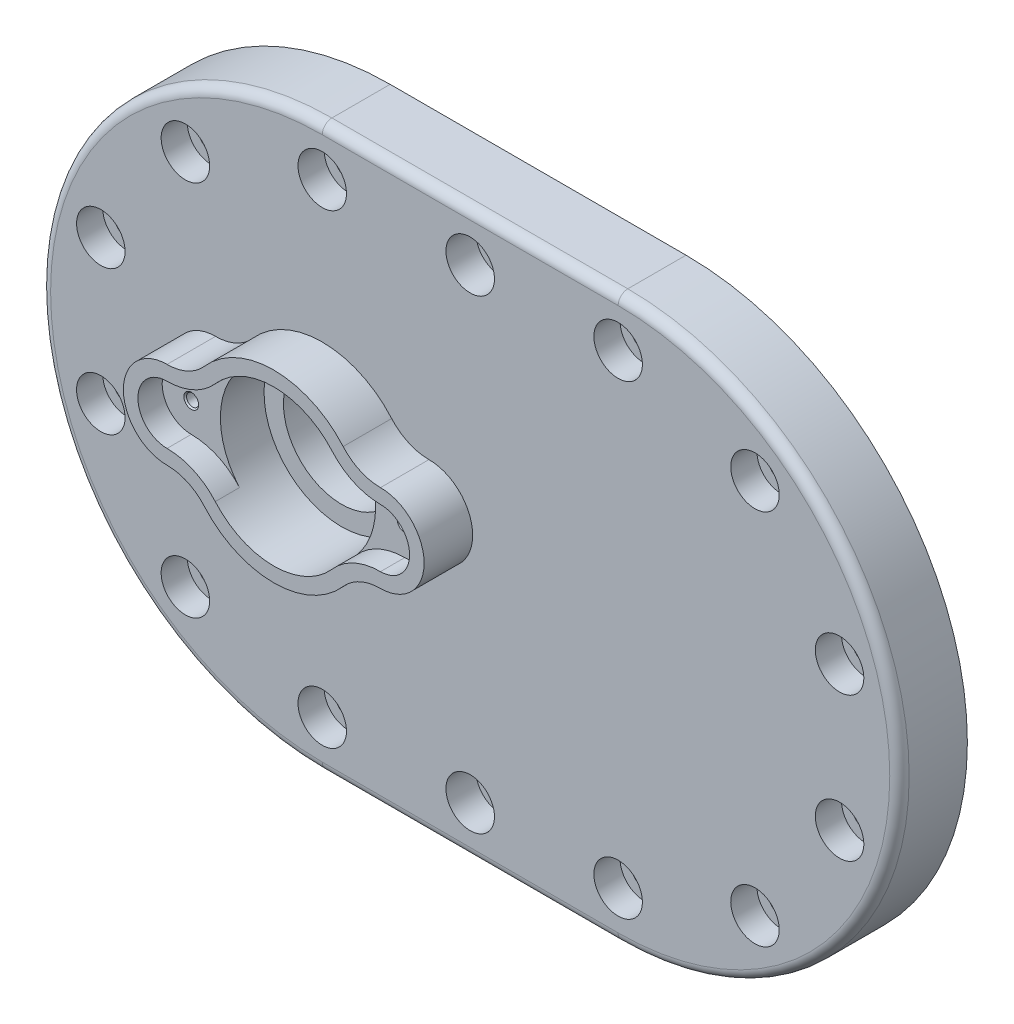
from build123d import *

# Parameters (mm, degrees)
BOSS_EXTRUDE1_DEPTH                                 = 14
BOSS_EXTRUDE3_DEPTH                                 = 10
BOSS_EXTRUDE4_DEPTH                                 = 5
CUT_EXTRUDE2_START                                  = -4
SKETCH6_6_R                                         = 12
CUT_EXTRUDE2_DEPTH                                  = 4
CUT_EXTRUDE3_REACH                                  = 108.734
SKETCH6_7_R                                         = 12
CBORE_FOR_M5_HEX_SOCKET_HEAD_CAP_SCREW1_D           = 5.5
CBORE_FOR_M5_HEX_SOCKET_HEAD_CAP_SCREW1_CBORE_D     = 10
CBORE_FOR_M5_HEX_SOCKET_HEAD_CAP_SCREW1_CBORE_DEPTH = 5.4
CIRPATTERN1_COUNT                                   = 6
CIRPATTERN1_ANGLE                                   = 180
MIRROR1_COPY_1_D                                    = 5.5
MIRROR1_COPY_1_CBORE_D                              = 10
MIRROR1_COPY_1_CBORE_DEPTH                          = 5.4
MIRROR1_COPY_2_D                                    = 5.5
MIRROR1_COPY_2_CBORE_D                              = 10
MIRROR1_COPY_2_CBORE_DEPTH                          = 5.4
MIRROR1_COPY_3_D                                    = 5.5
MIRROR1_COPY_3_CBORE_D                              = 10
MIRROR1_COPY_3_CBORE_DEPTH                          = 5.4
MIRROR1_COPY_4_D                                    = 5.5
MIRROR1_COPY_4_CBORE_D                              = 10
MIRROR1_COPY_4_CBORE_DEPTH                          = 5.4
MIRROR1_COPY_5_D                                    = 5.5
MIRROR1_COPY_5_CBORE_D                              = 10
MIRROR1_COPY_5_CBORE_DEPTH                          = 5.4
CBORE_FOR_M5_HEX_SOCKET_HEAD_CAP_SCREW2_D           = 5.5
CBORE_FOR_M5_HEX_SOCKET_HEAD_CAP_SCREW2_CBORE_D     = 10
CBORE_FOR_M5_HEX_SOCKET_HEAD_CAP_SCREW2_CBORE_DEPTH = 6.2
SKETCH23_R                                          = 12
CUT_EXTRUDE4_DEPTH                                  = 8
CHAMFER1_SIZE                                       = 1
M3_TAPPED_HOLE1_D                                   = 2.5
M3_TAPPED_HOLE1_DEPTH                               = 8.75
M3_TAPPED_HOLE1_CSINK_D                             = 3.05
M3_TAPPED_HOLE1_CSINK_ANGLE                         = 90
M3_TAPPED_HOLE1_TIP                                 = 1.25
FILLET1_R                                           = 2


with BuildPart() as part:
    # Sketch1 → Boss-Extrude1 (new body)
    with BuildSketch(Plane.XY):
        with BuildLine():
            Line((-30.5, 58), (30.5, 58))
            ThreePointArc((30.5, 58), (88.5, 0), (30.5, -58))
            Line((30.5, -58), (-30.5, -58))
            ThreePointArc((-30.5, -58), (-88.5, 0), (-30.5, 58))
        make_face()
    extrude(amount=BOSS_EXTRUDE1_DEPTH)

    # Sketch6 → Boss-Extrude3 (add)
    with BuildSketch(Plane.XY.offset(14)):
        with BuildLine():
            ThreePointArc((-8.5, 9), (-12.72079, 9.914262), (-16.184932, 12.493151))
            ThreePointArc((-16.184932, 12.493151), (-30.5, 19), (-44.815068, 12.493151))
            ThreePointArc((-44.815068, 12.493151), (-48.27921, 9.914262), (-52.5, 9))
            ThreePointArc((-52.5, 9), (-61.5, 0), (-52.5, -9))
            ThreePointArc((-52.5, -9), (-48.27921, -9.914262), (-44.815068, -12.493151))
            ThreePointArc((-44.815068, -12.493151), (-30.5, -19), (-16.184932, -12.493151))
            ThreePointArc((-16.184932, -12.493151), (-12.72079, -9.914262), (-8.5, -9))
            ThreePointArc((-8.5, -9), (0.5, 0), (-8.5, 9))
        make_face()
        with BuildLine():
            ThreePointArc((-52.5, -6), (-47.037801, -7.183162), (-42.554795, -10.520548))
            ThreePointArc((-42.554795, -10.520548), (-30.5, -16), (-18.445205, -10.520548))
            ThreePointArc((-18.445205, -10.520548), (-13.962199, -7.183162), (-8.5, -6))
            ThreePointArc((-8.5, -6), (-2.5, 0), (-8.5, 6))
            ThreePointArc((-8.5, 6), (-13.962199, 7.183162), (-18.445205, 10.520548))
            ThreePointArc((-18.445205, 10.520548), (-30.5, 16), (-42.554795, 10.520548))
            ThreePointArc((-42.554795, 10.520548), (-47.037801, 7.183162), (-52.5, 6))
            ThreePointArc((-52.5, 6), (-58.5, 0), (-52.5, -6))
        make_face(mode=Mode.SUBTRACT)
    extrude(amount=BOSS_EXTRUDE3_DEPTH)

    # Sketch6_3 → Boss-Extrude4 (add)
    with BuildSketch(Plane.XY.offset(14)):
        with BuildLine():
            ThreePointArc((-52.5, 6), (-58.5, 0), (-52.5, -6))
            ThreePointArc((-52.5, -6), (-47.037801, -7.183162), (-42.554795, -10.520548))
            ThreePointArc((-42.554795, -10.520548), (-46.5, 0), (-42.554795, 10.520548))
            ThreePointArc((-42.554795, 10.520548), (-47.037801, 7.183162), (-52.5, 6))
        make_face()
        with BuildLine():
            ThreePointArc((-14.5, 0), (-15.518733, -5.617975), (-18.445205, -10.520548))
            ThreePointArc((-18.445205, -10.520548), (-13.962199, -7.183162), (-8.5, -6))
            ThreePointArc((-8.5, -6), (-2.5, 0), (-8.5, 6))
            ThreePointArc((-8.5, 6), (-13.962199, 7.183162), (-18.445205, 10.520548))
            ThreePointArc((-18.445205, 10.520548), (-15.518733, 5.617975), (-14.5, 0))
        make_face()
    extrude(amount=BOSS_EXTRUDE4_DEPTH)

    # Sketch6_6 → Cut-Extrude2 (cut)
    # profile 1 of 2: a face of its own
    with BuildSketch(Plane.XY.offset(14).offset(CUT_EXTRUDE2_START)):
        with BuildLine():
            ThreePointArc((-42.554795, 10.520548), (-46.5, 0), (-42.554795, -10.520548))
            ThreePointArc((-42.554795, -10.520548), (-30.5, -16), (-18.445205, -10.520548))
            ThreePointArc((-18.445205, -10.520548), (-15.518733, -5.617975), (-14.5, 0))
            ThreePointArc((-14.5, 0), (-15.518733, 5.617975), (-18.445205, 10.520548))
            ThreePointArc((-18.445205, 10.520548), (-30.5, 16), (-42.554795, 10.520548))
        make_face()
        with Locations((-30.5, 0)):
            Circle(SKETCH6_6_R, mode=Mode.SUBTRACT)
    # profile 2 of 2: a face of its own
    with BuildSketch(Plane.XY.offset(14).offset(CUT_EXTRUDE2_START)):
        with Locations((-30.5, 0)):
            Circle(SKETCH6_6_R)
    extrude(amount=CUT_EXTRUDE2_DEPTH, mode=Mode.SUBTRACT)

    # Sketch6_7 → Cut-Extrude3 (cut, up to next)
    with BuildSketch(Plane.XY.offset(14), mode=Mode.PRIVATE) as cut_extrude3_sk1:
        with Locations((-30.5, 0)):
            Circle(SKETCH6_7_R)
    cut_extrude3_tool1 = extrude(cut_extrude3_sk1.sketch, amount=-CUT_EXTRUDE3_REACH, mode=Mode.PRIVATE) & part.part
    add(cut_extrude3_tool1.solids().sort_by_distance((-30.5, 0, 14))[0], mode=Mode.SUBTRACT)

    # CBORE for M5 Hex Socket Head Cap Screw1 (through all)
    with Locations(Plane.XY.offset(14)):
        with Locations((30.5, 48)):
            cbore_for_m5_hex_socket_head_cap_screw1 = CounterBoreHole(CBORE_FOR_M5_HEX_SOCKET_HEAD_CAP_SCREW1_D / 2, CBORE_FOR_M5_HEX_SOCKET_HEAD_CAP_SCREW1_CBORE_D / 2, CBORE_FOR_M5_HEX_SOCKET_HEAD_CAP_SCREW1_CBORE_DEPTH)

    # CirPattern1: CBORE for M5 Hex Socket Head Cap Screw1 ×6 about axis
    cirpattern1_axis = Axis((30.5, 0, 0), (0, 0, -1))
    for i in range(1, CIRPATTERN1_COUNT):
        add(cbore_for_m5_hex_socket_head_cap_screw1.rotate(cirpattern1_axis, i * CIRPATTERN1_ANGLE / (CIRPATTERN1_COUNT - 1)), mode=Mode.SUBTRACT)

    # Mirror1: CBORE for M5 Hex Socket Head Cap Screw1 across plane
    add(cbore_for_m5_hex_socket_head_cap_screw1.mirror(Plane(origin=(0, 0, 0), x_dir=(0, 0, 1), z_dir=(1, 0, 0))), mode=Mode.SUBTRACT)

    # Mirror1 copy 1 (through all)
    with Locations(Plane(origin=(-5.824982, 17.92745, 14), x_dir=(-0.8090169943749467, -0.5877852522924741, 0), z_dir=(0, 0, 1))):
        with Locations((30.5, -48)):
            CounterBoreHole(MIRROR1_COPY_1_D / 2, MIRROR1_COPY_1_CBORE_D / 2, MIRROR1_COPY_1_CBORE_DEPTH)

    # Mirror1 copy 2 (through all)
    with Locations(Plane(origin=(-21.074982, 29.007224, 14), x_dir=(-0.30901699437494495, -0.9510565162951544, 0), z_dir=(0, 0, 1))):
        with Locations((30.5, -48)):
            CounterBoreHole(MIRROR1_COPY_2_D / 2, MIRROR1_COPY_2_CBORE_D / 2, MIRROR1_COPY_2_CBORE_DEPTH)

    # Mirror1 copy 3 (through all)
    with Locations(Plane(origin=(-39.925018, 29.007224, 14), x_dir=(0.30901699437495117, -0.9510565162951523, 0), z_dir=(0, 0, 1))):
        with Locations((30.5, -48)):
            CounterBoreHole(MIRROR1_COPY_3_D / 2, MIRROR1_COPY_3_CBORE_D / 2, MIRROR1_COPY_3_CBORE_DEPTH)

    # Mirror1 copy 4 (through all)
    with Locations(Plane(origin=(-55.175018, 17.92745, 14), x_dir=(0.8090169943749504, -0.5877852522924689, 0), z_dir=(0, 0, 1))):
        with Locations((30.5, -48)):
            CounterBoreHole(MIRROR1_COPY_4_D / 2, MIRROR1_COPY_4_CBORE_D / 2, MIRROR1_COPY_4_CBORE_DEPTH)

    # Mirror1 copy 5 (through all)
    with Locations(Plane(origin=(-61, 0, 14), x_dir=(1, 0, 0), z_dir=(0, 0, 1))):
        with Locations((30.5, -48)):
            CounterBoreHole(MIRROR1_COPY_5_D / 2, MIRROR1_COPY_5_CBORE_D / 2, MIRROR1_COPY_5_CBORE_DEPTH)

    # CBORE for M5 Hex Socket Head Cap Screw2 (through all)
    with Locations(Plane.XY.offset(14)):
        with Locations((0, 48), (0, -48)):
            CounterBoreHole(CBORE_FOR_M5_HEX_SOCKET_HEAD_CAP_SCREW2_D / 2, CBORE_FOR_M5_HEX_SOCKET_HEAD_CAP_SCREW2_CBORE_D / 2, CBORE_FOR_M5_HEX_SOCKET_HEAD_CAP_SCREW2_CBORE_DEPTH)

    # Sketch23 → Cut-Extrude4 (cut)
    with BuildSketch(Plane(origin=(0, 0, 0), x_dir=(-1, 0, 0), z_dir=(0, 0, -1))):
        with Locations((-30.5, 0)):
            Circle(SKETCH23_R)
    extrude(amount=-CUT_EXTRUDE4_DEPTH, mode=Mode.SUBTRACT)

    # Chamfer1
    chamfer1_edges = [part.edges().sort_by_distance(p)[0] for p in [
        (42.5, 0, 0),
    ]]
    chamfer(chamfer1_edges, length=CHAMFER1_SIZE)

    # M3 Tapped Hole1
    with Locations(Plane.XY.offset(19)):
        with Locations((-8.5, 0), (-52.5, 0)):
            CounterSinkHole(M3_TAPPED_HOLE1_D / 2, M3_TAPPED_HOLE1_CSINK_D / 2, depth=M3_TAPPED_HOLE1_DEPTH, counter_sink_angle=M3_TAPPED_HOLE1_CSINK_ANGLE)
            with Locations((0, 0, -(M3_TAPPED_HOLE1_DEPTH + M3_TAPPED_HOLE1_TIP / 2))):  # 90° drill point
                Cone(0, M3_TAPPED_HOLE1_D / 2, M3_TAPPED_HOLE1_TIP, mode=Mode.SUBTRACT)

    # Fillet1
    fillet1_edges = [part.edges().sort_by_distance(p)[0] for p in [
        (88.5, 0, 14),
        (0, 58, 14),
        (-88.5, 0, 14),
        (0, -58, 14),
    ]]
    fillet(fillet1_edges, radius=FILLET1_R)


solid = part.part
